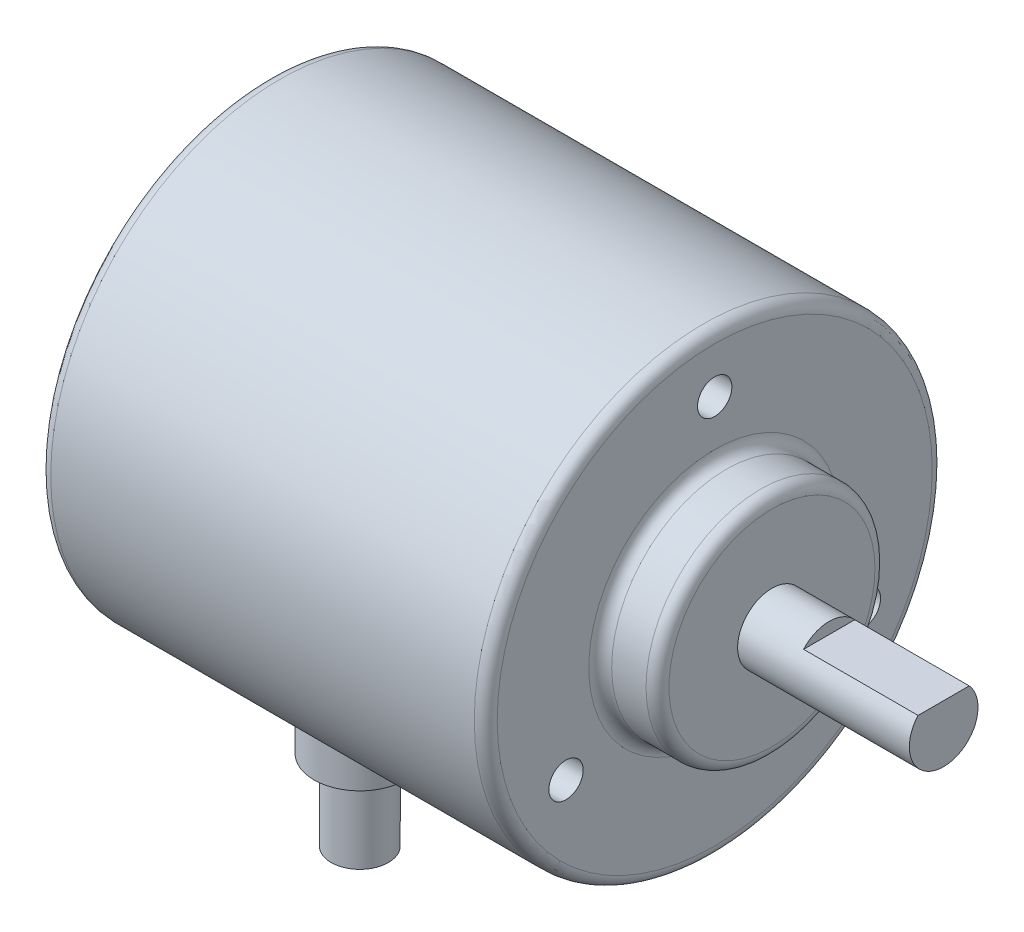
from build123d import *
from build123d.topology import SkipClean

# Parameters (mm, degrees)
SKETCH2_R                       = 20
BOSS_EXTRUDE1_DEPTH             = 39
SKETCH3_R                       = 10
BOSS_EXTRUDE2_DEPTH             = 5
SKETCH4_R                       = 3
BOSS_EXTRUDE3_DEPTH             = 15
CUT_EXTRUDE1_START              = -10
CUT_EXTRUDE1_DEPTH              = 10
SKETCH6_R                       = 1.5
CUT_EXTRUDE2_DEPTH              = 7
BOSS_EXTRUDE4_REACH             = 76.034
BOSS_EXTRUDE4_END_RADIUS        = 20
SKETCH8_R                       = 4
BOSS_EXTRUDE4_DIRECTION_2_DEPTH = 7.5
SKETCH9_R                       = 2.5
BOSS_EXTRUDE5_DEPTH             = 7
FILLET1_R                       = 1


with BuildPart() as part:
    # Sketch2 → Boss-Extrude1 (new body)
    with BuildSketch(Plane(origin=(0, 0, 0), x_dir=(0, 0, -1), z_dir=(1, 0, 0))):
        Circle(SKETCH2_R)
    extrude(amount=BOSS_EXTRUDE1_DEPTH)

    # Sketch3 → Boss-Extrude2 (add)
    with BuildSketch(Plane(origin=(39, 0, 0), x_dir=(0, 0, -1), z_dir=(1, 0, 0))):
        Circle(SKETCH3_R)
    extrude(amount=BOSS_EXTRUDE2_DEPTH)

    # Sketch4 → Boss-Extrude3 (add)
    with BuildSketch(Plane(origin=(44, 0, 0), x_dir=(0, 0, -1), z_dir=(1, 0, 0))):
        Circle(SKETCH4_R)
    extrude(amount=BOSS_EXTRUDE3_DEPTH)

    # Sketch5 → Cut-Extrude1 (cut)
    with BuildSketch(Plane(origin=(59, 0, 0), x_dir=(0, 0, -1), z_dir=(1, 0, 0)).offset(CUT_EXTRUDE1_START)):
        with BuildLine():
            Line((-2.236067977, 2), (2.236067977, 2))
            ThreePointArc((2.236067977, 2), (0, 3), (-2.236067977, 2))
        make_face()
    extrude(amount=CUT_EXTRUDE1_DEPTH, mode=Mode.SUBTRACT)

    # Sketch6 → Cut-Extrude2 (cut)
    with BuildSketch(Plane(origin=(39, 0, 0), x_dir=(0, 0, -1), z_dir=(1, 0, 0))):
        with Locations((0, 15)):
            Circle(SKETCH6_R)
        with Locations((12.990381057, -7.5)):
            Circle(SKETCH6_R)
        with Locations((-12.990381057, -7.5)):
            Circle(SKETCH6_R)
    extrude(amount=-CUT_EXTRUDE2_DEPTH, mode=Mode.SUBTRACT)

    # Boss-Extrude4: up to this cylinder (the profile starts outside it)
    with SkipClean():  # the faces are left unmerged after this step: merging them gives an invalid solid
        boss_extrude4_end = Plane(origin=(8, 0, 0), z_dir=(-1, 0, 0)) * Cylinder(BOSS_EXTRUDE4_END_RADIUS, 193.068, mode=Mode.PRIVATE)
        # Sketch8 → Boss-Extrude4 (add, up to the surface)
        with BuildSketch(Plane(origin=(0, -20, 0), x_dir=(1, 0, 0), z_dir=(0, 1, 0)), mode=Mode.PRIVATE) as boss_extrude4_sk1:
            with Locations(Location((8, 0, 0), (0, 0, 270))):
                Circle(SKETCH8_R)
        boss_extrude4_tool1 = extrude(boss_extrude4_sk1.sketch, amount=BOSS_EXTRUDE4_REACH, mode=Mode.PRIVATE) - boss_extrude4_end
        add(boss_extrude4_tool1.solids().sort_by_distance((8, -20, 0))[0])
        add(boss_extrude4_tool1.solids().sort_by_distance((8, -20, 0))[1])

    # Sketch8 → Boss-Extrude4 direction 2 (add)
    with BuildSketch(Plane(origin=(0, -20, 0), x_dir=(1, 0, 0), z_dir=(0, 1, 0))):
        with Locations(Location((8, 0, 0), (0, 0, 270))):
            Circle(SKETCH8_R)
    extrude(amount=-BOSS_EXTRUDE4_DIRECTION_2_DEPTH)

    # Sketch9 → Boss-Extrude5 (add)
    with BuildSketch(Plane.XZ.offset(27.5)):
        with Locations(Location((8, 0, 0), (0, 0, 90))):
            Circle(SKETCH9_R)
    extrude(amount=BOSS_EXTRUDE5_DEPTH)

    # Fillet1
    fillet1_edges = [part.edges().sort_by_distance(p)[0] for p in [
        (0, 0, 20),
        (8, -19.595917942, -4),
        (8, -27.5, -2.5),
        (39, 0, 20),
        (39, 0, 10),
        (44, 0, 10),
    ]]
    fillet(fillet1_edges, radius=FILLET1_R)


solid = part.part
